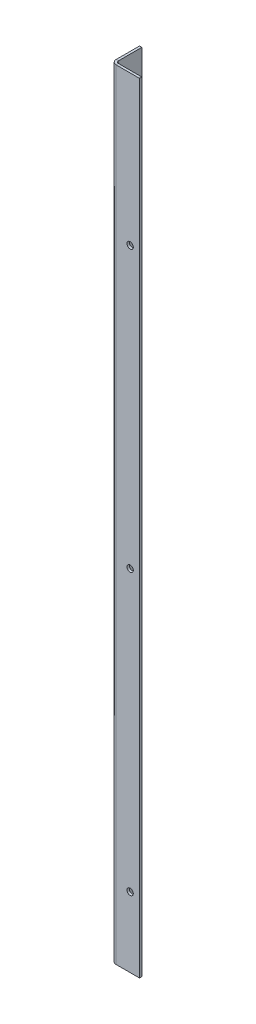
ISO-10303-21;
HEADER;
FILE_DESCRIPTION(('STEP AP214'),'2;1');
FILE_NAME('part.step','',(''),(''),'','','');
FILE_SCHEMA(('AUTOMOTIVE_DESIGN { 1 0 10303 214 1 1 1 1 }'));
ENDSEC;
DATA;
#1=APPLICATION_CONTEXT('core data for automotive mechanical design processes');
#2=APPLICATION_PROTOCOL_DEFINITION('international standard','automotive_design',2000,#1);
#3=PRODUCT_CONTEXT('',#1,'mechanical');
#4=PRODUCT('Part','Part','',(#3));
#5=PRODUCT_RELATED_PRODUCT_CATEGORY('part','',(#4));
#6=PRODUCT_DEFINITION_FORMATION('','',#4);
#7=PRODUCT_DEFINITION_CONTEXT('part definition',#1,'design');
#8=PRODUCT_DEFINITION('design','',#6,#7);
#9=PRODUCT_DEFINITION_SHAPE('','',#8);
#10=(LENGTH_UNIT() NAMED_UNIT(*) SI_UNIT(.MILLI.,.METRE.));
#11=(NAMED_UNIT(*) PLANE_ANGLE_UNIT() SI_UNIT($,.RADIAN.));
#12=(NAMED_UNIT(*) SI_UNIT($,.STERADIAN.) SOLID_ANGLE_UNIT());
#13=UNCERTAINTY_MEASURE_WITH_UNIT(LENGTH_MEASURE(1.E-05),#10,'distance_accuracy_value','');
#14=(GEOMETRIC_REPRESENTATION_CONTEXT(3) GLOBAL_UNCERTAINTY_ASSIGNED_CONTEXT((#13)) GLOBAL_UNIT_ASSIGNED_CONTEXT((#10,
#11,#12)) REPRESENTATION_CONTEXT('',''));
#15=CARTESIAN_POINT('',(0.,0.,0.));
#16=DIRECTION('',(0.,0.,1.));
#17=DIRECTION('',(1.,0.,0.));
#18=AXIS2_PLACEMENT_3D('',#15,#16,#17);
#19=CARTESIAN_POINT('',(5.,0.,30.));
#20=DIRECTION('',(0.,-1.00000000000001,0.));
#21=DIRECTION('',(0.,0.,-1.));
#22=AXIS2_PLACEMENT_3D('',#19,#20,#21);
#23=PLANE('',#22);
#24=CARTESIAN_POINT('',(5.,0.,25.));
#25=DIRECTION('',(0.,-1.00000000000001,0.));
#26=DIRECTION('',(0.,0.,-1.));
#27=AXIS2_PLACEMENT_3D('',#24,#25,#26);
#28=CIRCLE('',#27,5.);
#29=CARTESIAN_POINT('',(0.669872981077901,0.,27.5000000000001));
#30=VERTEX_POINT('',#29);
#31=CARTESIAN_POINT('',(5.,0.,30.));
#32=VERTEX_POINT('',#31);
#33=EDGE_CURVE('E129',#30,#32,#28,.F.);
#34=ORIENTED_EDGE('',*,*,#33,.F.);
#35=DIRECTION('',(-0.866025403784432,0.,0.50000000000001));
#36=VECTOR('',#35,1.);
#37=CARTESIAN_POINT('',(0.669872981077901,0.,27.5000000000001));
#38=LINE('',#37,#36);
#39=CARTESIAN_POINT('',(2.8349364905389,0.,26.25));
#40=VERTEX_POINT('',#39);
#41=EDGE_CURVE('E60',#30,#40,#38,.F.);
#42=ORIENTED_EDGE('',*,*,#41,.T.);
#43=CARTESIAN_POINT('',(5.,0.,25.));
#44=DIRECTION('',(0.,1.00000000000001,0.));
#45=DIRECTION('',(1.,0.,0.));
#46=AXIS2_PLACEMENT_3D('',#43,#44,#45);
#47=CIRCLE('',#46,2.5);
#48=CARTESIAN_POINT('',(5.,0.,27.5));
#49=VERTEX_POINT('',#48);
#50=EDGE_CURVE('E127',#40,#49,#47,.T.);
#51=ORIENTED_EDGE('',*,*,#50,.T.);
#52=DIRECTION('',(0.,0.,-1.));
#53=VECTOR('',#52,1.);
#54=CARTESIAN_POINT('',(5.,0.,30.));
#55=LINE('',#54,#53);
#56=EDGE_CURVE('E207',#32,#49,#55,.T.);
#57=ORIENTED_EDGE('',*,*,#56,.F.);
#58=EDGE_LOOP('',(#34,#42,#51,#57));
#59=FACE_BOUND('',#58,.T.);
#60=ADVANCED_FACE('F42',(#59),#23,.T.);
#61=CARTESIAN_POINT('',(5.00000000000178,835.00000000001,25.));
#62=DIRECTION('',(0.,-1.00000000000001,0.));
#63=DIRECTION('',(0.,0.,-1.));
#64=AXIS2_PLACEMENT_3D('',#61,#62,#63);
#65=CYLINDRICAL_SURFACE('',#64,2.5);
#66=ORIENTED_EDGE('',*,*,#50,.F.);
#67=CARTESIAN_POINT('',(5.,2.50000000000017,25.));
#68=DIRECTION('',(0.,0.447213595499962,0.894427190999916));
#69=DIRECTION('',(0.,-0.894427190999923,0.447213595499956));
#70=AXIS2_PLACEMENT_3D('',#67,#68,#69);
#71=ELLIPSE('',#70,5.59016994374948,2.5);
#72=CARTESIAN_POINT('',(2.50000000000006,2.49999999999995,25.));
#73=VERTEX_POINT('',#72);
#74=EDGE_CURVE('E113',#73,#40,#71,.T.);
#75=ORIENTED_EDGE('',*,*,#74,.F.);
#76=DIRECTION('',(0.,-1.00000000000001,0.));
#77=VECTOR('',#76,1.);
#78=CARTESIAN_POINT('',(2.50000000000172,835.00000000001,25.));
#79=LINE('',#78,#77);
#80=CARTESIAN_POINT('',(2.50000000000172,835.00000000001,25.));
#81=VERTEX_POINT('',#80);
#82=EDGE_CURVE('E196',#81,#73,#79,.T.);
#83=ORIENTED_EDGE('',*,*,#82,.F.);
#84=CARTESIAN_POINT('',(5.00000000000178,835.00000000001,25.));
#85=DIRECTION('',(0.,1.00000000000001,0.));
#86=DIRECTION('',(1.,0.,0.));
#87=AXIS2_PLACEMENT_3D('',#84,#85,#86);
#88=CIRCLE('',#87,2.5);
#89=CARTESIAN_POINT('',(5.00000000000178,835.00000000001,27.5));
#90=VERTEX_POINT('',#89);
#91=EDGE_CURVE('E162',#81,#90,#88,.T.);
#92=ORIENTED_EDGE('',*,*,#91,.T.);
#93=DIRECTION('',(0.,-1.00000000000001,0.));
#94=VECTOR('',#93,1.);
#95=CARTESIAN_POINT('',(5.00000000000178,835.00000000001,27.5));
#96=LINE('',#95,#94);
#97=EDGE_CURVE('E137',#90,#49,#96,.T.);
#98=ORIENTED_EDGE('',*,*,#97,.T.);
#99=EDGE_LOOP('',(#66,#75,#83,#92,#98));
#100=FACE_BOUND('',#99,.T.);
#101=ADVANCED_FACE('F134',(#100),#65,.F.);
#102=CARTESIAN_POINT('',(2.50000000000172,835.00000000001,0.));
#103=DIRECTION('',(1.,0.,0.));
#104=DIRECTION('',(0.,0.,-1.));
#105=AXIS2_PLACEMENT_3D('',#102,#103,#104);
#106=PLANE('',#105);
#107=CARTESIAN_POINT('',(2.50000000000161,155.000000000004,15.0000000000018));
#108=DIRECTION('',(1.,0.,0.));
#109=DIRECTION('',(0.,0.,-1.));
#110=AXIS2_PLACEMENT_3D('',#107,#108,#109);
#111=CIRCLE('',#110,4.55);
#112=CARTESIAN_POINT('',(2.5000000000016,155.000000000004,10.4500000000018));
#113=VERTEX_POINT('',#112);
#114=EDGE_CURVE('E381',#113,#113,#111,.T.);
#115=ORIENTED_EDGE('',*,*,#114,.F.);
#116=EDGE_LOOP('',(#115));
#117=FACE_BOUND('',#116,.T.);
#118=CARTESIAN_POINT('',(2.50000000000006,125.000000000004,15.));
#119=DIRECTION('',(1.,0.,0.));
#120=DIRECTION('',(0.,0.,-1.));
#121=AXIS2_PLACEMENT_3D('',#118,#119,#120);
#122=CIRCLE('',#121,4.55);
#123=CARTESIAN_POINT('',(2.50000000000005,125.000000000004,10.45));
#124=VERTEX_POINT('',#123);
#125=EDGE_CURVE('E395',#124,#124,#122,.T.);
#126=ORIENTED_EDGE('',*,*,#125,.F.);
#127=EDGE_LOOP('',(#126));
#128=FACE_BOUND('',#127,.T.);
#129=CARTESIAN_POINT('',(2.50000000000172,725.000000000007,15.0000000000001));
#130=DIRECTION('',(1.,0.,0.));
#131=DIRECTION('',(0.,0.,-1.));
#132=AXIS2_PLACEMENT_3D('',#129,#130,#131);
#133=CIRCLE('',#132,4.54999999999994);
#134=CARTESIAN_POINT('',(2.50000000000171,725.000000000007,10.4500000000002));
#135=VERTEX_POINT('',#134);
#136=EDGE_CURVE('E403',#135,#135,#133,.T.);
#137=ORIENTED_EDGE('',*,*,#136,.F.);
#138=EDGE_LOOP('',(#137));
#139=FACE_BOUND('',#138,.T.);
#140=CARTESIAN_POINT('',(2.50000000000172,755.000000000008,15.0000000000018));
#141=DIRECTION('',(1.,0.,0.));
#142=DIRECTION('',(0.,0.,-1.));
#143=AXIS2_PLACEMENT_3D('',#140,#141,#142);
#144=CIRCLE('',#143,4.54999999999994);
#145=CARTESIAN_POINT('',(2.50000000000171,755.000000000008,10.4500000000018));
#146=VERTEX_POINT('',#145);
#147=EDGE_CURVE('E409',#146,#146,#144,.T.);
#148=ORIENTED_EDGE('',*,*,#147,.F.);
#149=EDGE_LOOP('',(#148));
#150=FACE_BOUND('',#149,.T.);
#151=ORIENTED_EDGE('',*,*,#82,.T.);
#152=DIRECTION('',(0.,-0.707106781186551,0.707106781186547));
#153=VECTOR('',#152,1.);
#154=CARTESIAN_POINT('',(2.50000000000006,0.,27.5));
#155=LINE('',#154,#153);
#156=CARTESIAN_POINT('',(2.50000000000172,27.5000000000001,1.77635683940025E-12));
#157=VERTEX_POINT('',#156);
#158=EDGE_CURVE('E241',#157,#73,#155,.T.);
#159=ORIENTED_EDGE('',*,*,#158,.F.);
#160=DIRECTION('',(0.,-1.00000000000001,0.));
#161=VECTOR('',#160,1.);
#162=CARTESIAN_POINT('',(2.50000000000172,835.00000000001,0.));
#163=LINE('',#162,#161);
#164=CARTESIAN_POINT('',(2.50000000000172,835.00000000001,0.));
#165=VERTEX_POINT('',#164);
#166=EDGE_CURVE('E192',#165,#157,#163,.T.);
#167=ORIENTED_EDGE('',*,*,#166,.F.);
#168=DIRECTION('',(0.,0.,1.));
#169=VECTOR('',#168,1.);
#170=CARTESIAN_POINT('',(2.50000000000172,835.00000000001,0.));
#171=LINE('',#170,#169);
#172=EDGE_CURVE('E165',#165,#81,#171,.T.);
#173=ORIENTED_EDGE('',*,*,#172,.T.);
#174=EDGE_LOOP('',(#151,#159,#167,#173));
#175=FACE_BOUND('',#174,.T.);
#176=ADVANCED_FACE('F281',(#117,#128,#139,#150,#175),#106,.T.);
#177=CARTESIAN_POINT('',(1.77635683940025E-12,835.00000000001,0.));
#178=DIRECTION('',(0.,0.,-1.));
#179=DIRECTION('',(-1.,0.,0.));
#180=AXIS2_PLACEMENT_3D('',#177,#178,#179);
#181=PLANE('',#180);
#182=ORIENTED_EDGE('',*,*,#166,.T.);
#183=DIRECTION('',(-1.,0.,0.));
#184=VECTOR('',#183,1.);
#185=CARTESIAN_POINT('',(1.66533453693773E-12,27.5000000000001,1.77635683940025E-12));
#186=LINE('',#185,#184);
#187=CARTESIAN_POINT('',(1.66533453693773E-12,27.5000000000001,1.77635683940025E-12));
#188=VERTEX_POINT('',#187);
#189=EDGE_CURVE('E244',#188,#157,#186,.F.);
#190=ORIENTED_EDGE('',*,*,#189,.F.);
#191=DIRECTION('',(0.,-1.00000000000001,0.));
#192=VECTOR('',#191,1.);
#193=CARTESIAN_POINT('',(1.77635683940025E-12,835.00000000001,0.));
#194=LINE('',#193,#192);
#195=CARTESIAN_POINT('',(1.77635683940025E-12,835.00000000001,0.));
#196=VERTEX_POINT('',#195);
#197=EDGE_CURVE('E188',#196,#188,#194,.T.);
#198=ORIENTED_EDGE('',*,*,#197,.F.);
#199=DIRECTION('',(1.,0.,0.));
#200=VECTOR('',#199,1.);
#201=CARTESIAN_POINT('',(1.77635683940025E-12,835.00000000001,0.));
#202=LINE('',#201,#200);
#203=EDGE_CURVE('E169',#196,#165,#202,.T.);
#204=ORIENTED_EDGE('',*,*,#203,.T.);
#205=EDGE_LOOP('',(#182,#190,#198,#204));
#206=FACE_BOUND('',#205,.T.);
#207=ADVANCED_FACE('F279',(#206),#181,.T.);
#208=CARTESIAN_POINT('',(1.77635683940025E-12,835.00000000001,0.));
#209=DIRECTION('',(1.,0.,0.));
#210=DIRECTION('',(0.,0.,-1.));
#211=AXIS2_PLACEMENT_3D('',#208,#209,#210);
#212=PLANE('',#211);
#213=CARTESIAN_POINT('',(1.66533453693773E-12,155.000000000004,15.0000000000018));
#214=DIRECTION('',(-1.,0.,0.));
#215=DIRECTION('',(0.,0.,1.));
#216=AXIS2_PLACEMENT_3D('',#213,#214,#215);
#217=CIRCLE('',#216,4.55);
#218=CARTESIAN_POINT('',(1.67346900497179E-12,155.000000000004,19.5500000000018));
#219=VERTEX_POINT('',#218);
#220=EDGE_CURVE('E384',#219,#219,#217,.T.);
#221=ORIENTED_EDGE('',*,*,#220,.F.);
#222=EDGE_LOOP('',(#221));
#223=FACE_BOUND('',#222,.T.);
#224=CARTESIAN_POINT('',(1.11022302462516E-13,125.000000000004,15.));
#225=DIRECTION('',(-1.,0.,0.));
#226=DIRECTION('',(0.,0.,1.));
#227=AXIS2_PLACEMENT_3D('',#224,#225,#226);
#228=CIRCLE('',#227,4.55);
#229=CARTESIAN_POINT('',(1.19156770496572E-13,125.000000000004,19.55));
#230=VERTEX_POINT('',#229);
#231=EDGE_CURVE('E389',#230,#230,#228,.T.);
#232=ORIENTED_EDGE('',*,*,#231,.F.);
#233=EDGE_LOOP('',(#232));
#234=FACE_BOUND('',#233,.T.);
#235=CARTESIAN_POINT('',(1.77635683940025E-12,725.000000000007,15.0000000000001));
#236=DIRECTION('',(-1.,0.,0.));
#237=DIRECTION('',(0.,0.,1.));
#238=AXIS2_PLACEMENT_3D('',#235,#236,#237);
#239=CIRCLE('',#238,4.54999999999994);
#240=CARTESIAN_POINT('',(1.78449130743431E-12,725.000000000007,19.5500000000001));
#241=VERTEX_POINT('',#240);
#242=EDGE_CURVE('E399',#241,#241,#239,.T.);
#243=ORIENTED_EDGE('',*,*,#242,.F.);
#244=EDGE_LOOP('',(#243));
#245=FACE_BOUND('',#244,.T.);
#246=CARTESIAN_POINT('',(1.77635683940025E-12,755.000000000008,15.0000000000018));
#247=DIRECTION('',(-1.,0.,0.));
#248=DIRECTION('',(0.,0.,1.));
#249=AXIS2_PLACEMENT_3D('',#246,#247,#248);
#250=CIRCLE('',#249,4.54999999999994);
#251=CARTESIAN_POINT('',(1.78449130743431E-12,755.000000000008,19.5500000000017));
#252=VERTEX_POINT('',#251);
#253=EDGE_CURVE('E407',#252,#252,#250,.T.);
#254=ORIENTED_EDGE('',*,*,#253,.F.);
#255=EDGE_LOOP('',(#254));
#256=FACE_BOUND('',#255,.T.);
#257=DIRECTION('',(0.,-0.707106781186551,0.707106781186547));
#258=VECTOR('',#257,1.);
#259=CARTESIAN_POINT('',(0.,0.,27.5));
#260=LINE('',#259,#258);
#261=CARTESIAN_POINT('',(0.,2.49999999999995,25.));
#262=VERTEX_POINT('',#261);
#263=EDGE_CURVE('E131',#188,#262,#260,.T.);
#264=ORIENTED_EDGE('',*,*,#263,.T.);
#265=DIRECTION('',(0.,-1.00000000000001,0.));
#266=VECTOR('',#265,1.);
#267=CARTESIAN_POINT('',(1.77635683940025E-12,835.00000000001,25.));
#268=LINE('',#267,#266);
#269=CARTESIAN_POINT('',(1.77635683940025E-12,835.00000000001,25.));
#270=VERTEX_POINT('',#269);
#271=EDGE_CURVE('E184',#270,#262,#268,.T.);
#272=ORIENTED_EDGE('',*,*,#271,.F.);
#273=DIRECTION('',(0.,0.,1.));
#274=VECTOR('',#273,1.);
#275=CARTESIAN_POINT('',(1.77635683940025E-12,835.00000000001,0.));
#276=LINE('',#275,#274);
#277=EDGE_CURVE('E173',#196,#270,#276,.T.);
#278=ORIENTED_EDGE('',*,*,#277,.F.);
#279=ORIENTED_EDGE('',*,*,#197,.T.);
#280=EDGE_LOOP('',(#264,#272,#278,#279));
#281=FACE_BOUND('',#280,.T.);
#282=ADVANCED_FACE('F275',(#223,#234,#245,#256,#281),#212,.F.);
#283=CARTESIAN_POINT('',(5.00000000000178,835.00000000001,25.));
#284=DIRECTION('',(0.,-1.00000000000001,0.));
#285=DIRECTION('',(0.,0.,-1.));
#286=AXIS2_PLACEMENT_3D('',#283,#284,#285);
#287=CYLINDRICAL_SURFACE('',#286,5.);
#288=CARTESIAN_POINT('',(5.,2.50000000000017,25.));
#289=DIRECTION('',(0.,0.707106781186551,0.707106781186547));
#290=DIRECTION('',(0.,-0.707106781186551,0.707106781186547));
#291=AXIS2_PLACEMENT_3D('',#288,#289,#290);
#292=ELLIPSE('',#291,7.07106781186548,5.);
#293=EDGE_CURVE('E122',#262,#30,#292,.T.);
#294=ORIENTED_EDGE('',*,*,#293,.T.);
#295=ORIENTED_EDGE('',*,*,#33,.T.);
#296=DIRECTION('',(0.,-1.00000000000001,0.));
#297=VECTOR('',#296,1.);
#298=CARTESIAN_POINT('',(5.00000000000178,835.00000000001,30.));
#299=LINE('',#298,#297);
#300=CARTESIAN_POINT('',(5.00000000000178,835.00000000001,30.));
#301=VERTEX_POINT('',#300);
#302=EDGE_CURVE('E180',#301,#32,#299,.T.);
#303=ORIENTED_EDGE('',*,*,#302,.F.);
#304=CARTESIAN_POINT('',(5.00000000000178,835.00000000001,25.));
#305=DIRECTION('',(0.,-1.00000000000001,0.));
#306=DIRECTION('',(0.,0.,-1.));
#307=AXIS2_PLACEMENT_3D('',#304,#305,#306);
#308=CIRCLE('',#307,5.);
#309=EDGE_CURVE('E177',#270,#301,#308,.F.);
#310=ORIENTED_EDGE('',*,*,#309,.F.);
#311=ORIENTED_EDGE('',*,*,#271,.T.);
#312=EDGE_LOOP('',(#294,#295,#303,#310,#311));
#313=FACE_BOUND('',#312,.T.);
#314=ADVANCED_FACE('F268',(#313),#287,.T.);
#315=CARTESIAN_POINT('',(1.77635683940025E-12,835.00000000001,25.));
#316=DIRECTION('',(0.,1.00000000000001,0.));
#317=DIRECTION('',(0.,0.,1.));
#318=AXIS2_PLACEMENT_3D('',#315,#316,#317);
#319=PLANE('',#318);
#320=DIRECTION('',(1.,0.,0.));
#321=VECTOR('',#320,1.);
#322=CARTESIAN_POINT('',(1.77635683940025E-12,835.00000000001,25.));
#323=LINE('',#322,#321);
#324=EDGE_CURVE('E11',#270,#81,#323,.T.);
#325=ORIENTED_EDGE('',*,*,#324,.F.);
#326=ORIENTED_EDGE('',*,*,#309,.T.);
#327=DIRECTION('',(0.,0.,1.));
#328=VECTOR('',#327,1.);
#329=CARTESIAN_POINT('',(5.00000000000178,835.00000000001,27.5));
#330=LINE('',#329,#328);
#331=EDGE_CURVE('E52',#90,#301,#330,.T.);
#332=ORIENTED_EDGE('',*,*,#331,.F.);
#333=ORIENTED_EDGE('',*,*,#91,.F.);
#334=EDGE_LOOP('',(#325,#326,#332,#333));
#335=FACE_BOUND('',#334,.T.);
#336=ADVANCED_FACE('F44',(#335),#319,.T.);
#337=CARTESIAN_POINT('',(5.00000000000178,835.00000000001,27.5));
#338=DIRECTION('',(0.,1.00000000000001,0.));
#339=DIRECTION('',(0.,0.,1.));
#340=AXIS2_PLACEMENT_3D('',#337,#338,#339);
#341=PLANE('',#340);
#342=ORIENTED_EDGE('',*,*,#277,.T.);
#343=ORIENTED_EDGE('',*,*,#324,.T.);
#344=ORIENTED_EDGE('',*,*,#172,.F.);
#345=ORIENTED_EDGE('',*,*,#203,.F.);
#346=EDGE_LOOP('',(#342,#343,#344,#345));
#347=FACE_BOUND('',#346,.T.);
#348=ADVANCED_FACE('F306',(#347),#341,.T.);
#349=CARTESIAN_POINT('',(2.50000000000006,0.,25.));
#350=DIRECTION('',(0.,-1.00000000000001,0.));
#351=DIRECTION('',(0.,0.,-1.));
#352=AXIS2_PLACEMENT_3D('',#349,#350,#351);
#353=PLANE('',#352);
#354=DIRECTION('',(1.,0.,0.));
#355=VECTOR('',#354,1.);
#356=CARTESIAN_POINT('',(0.,0.,30.));
#357=LINE('',#356,#355);
#358=CARTESIAN_POINT('',(30.,3.33066907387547E-12,30.));
#359=VERTEX_POINT('',#358);
#360=EDGE_CURVE('E247',#32,#359,#357,.T.);
#361=ORIENTED_EDGE('',*,*,#360,.F.);
#362=ORIENTED_EDGE('',*,*,#56,.T.);
#363=DIRECTION('',(1.,0.,0.));
#364=VECTOR('',#363,1.);
#365=CARTESIAN_POINT('',(0.,0.,27.5));
#366=LINE('',#365,#364);
#367=CARTESIAN_POINT('',(30.,3.33066907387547E-12,27.5));
#368=VERTEX_POINT('',#367);
#369=EDGE_CURVE('E140',#49,#368,#366,.T.);
#370=ORIENTED_EDGE('',*,*,#369,.T.);
#371=DIRECTION('',(0.,0.,1.));
#372=VECTOR('',#371,1.);
#373=CARTESIAN_POINT('',(30.,3.33066907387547E-12,27.5));
#374=LINE('',#373,#372);
#375=EDGE_CURVE('E148',#368,#359,#374,.T.);
#376=ORIENTED_EDGE('',*,*,#375,.T.);
#377=EDGE_LOOP('',(#361,#362,#370,#376));
#378=FACE_BOUND('',#377,.T.);
#379=ADVANCED_FACE('F257',(#378),#353,.T.);
#380=CARTESIAN_POINT('',(1.77635683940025E-12,835.00000000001,30.));
#381=DIRECTION('',(0.,0.,-0.999999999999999));
#382=DIRECTION('',(-1.,0.,0.));
#383=AXIS2_PLACEMENT_3D('',#380,#381,#382);
#384=PLANE('',#383);
#385=CARTESIAN_POINT('',(20.0000000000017,75.0000000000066,30.));
#386=DIRECTION('',(0.,0.,1.));
#387=DIRECTION('',(1.,0.,0.));
#388=AXIS2_PLACEMENT_3D('',#385,#386,#387);
#389=CIRCLE('',#388,3.40000000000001);
#390=CARTESIAN_POINT('',(23.4000000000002,75.0000000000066,30.));
#391=VERTEX_POINT('',#390);
#392=EDGE_CURVE('E232',#391,#391,#389,.T.);
#393=ORIENTED_EDGE('',*,*,#392,.F.);
#394=EDGE_LOOP('',(#393));
#395=FACE_BOUND('',#394,.T.);
#396=CARTESIAN_POINT('',(20.0000000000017,375.000000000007,30.0000000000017));
#397=DIRECTION('',(0.,0.,1.));
#398=DIRECTION('',(1.,0.,0.));
#399=AXIS2_PLACEMENT_3D('',#396,#397,#398);
#400=CIRCLE('',#399,3.39999999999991);
#401=CARTESIAN_POINT('',(23.4000000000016,375.00000000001,30.0000000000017));
#402=VERTEX_POINT('',#401);
#403=EDGE_CURVE('E219',#402,#402,#400,.T.);
#404=ORIENTED_EDGE('',*,*,#403,.F.);
#405=EDGE_LOOP('',(#404));
#406=FACE_BOUND('',#405,.T.);
#407=CARTESIAN_POINT('',(20.0000000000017,675.000000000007,30.));
#408=DIRECTION('',(0.,0.,1.));
#409=DIRECTION('',(1.,0.,0.));
#410=AXIS2_PLACEMENT_3D('',#407,#408,#409);
#411=CIRCLE('',#410,3.39999999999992);
#412=CARTESIAN_POINT('',(23.4000000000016,675.000000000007,30.));
#413=VERTEX_POINT('',#412);
#414=EDGE_CURVE('E215',#413,#413,#411,.T.);
#415=ORIENTED_EDGE('',*,*,#414,.F.);
#416=EDGE_LOOP('',(#415));
#417=FACE_BOUND('',#416,.T.);
#418=ORIENTED_EDGE('',*,*,#360,.T.);
#419=DIRECTION('',(0.,-1.00000000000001,0.));
#420=VECTOR('',#419,1.);
#421=CARTESIAN_POINT('',(30.0000000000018,835.000000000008,30.));
#422=LINE('',#421,#420);
#423=CARTESIAN_POINT('',(30.0000000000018,835.000000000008,30.));
#424=VERTEX_POINT('',#423);
#425=EDGE_CURVE('E204',#424,#359,#422,.T.);
#426=ORIENTED_EDGE('',*,*,#425,.F.);
#427=DIRECTION('',(1.,0.,0.));
#428=VECTOR('',#427,1.);
#429=CARTESIAN_POINT('',(1.77635683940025E-12,835.00000000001,30.));
#430=LINE('',#429,#428);
#431=EDGE_CURVE('E144',#301,#424,#430,.T.);
#432=ORIENTED_EDGE('',*,*,#431,.F.);
#433=ORIENTED_EDGE('',*,*,#302,.T.);
#434=EDGE_LOOP('',(#418,#426,#432,#433));
#435=FACE_BOUND('',#434,.T.);
#436=ADVANCED_FACE('F264',(#395,#406,#417,#435),#384,.F.);
#437=CARTESIAN_POINT('',(30.0000000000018,835.000000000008,27.5));
#438=DIRECTION('',(1.,0.,0.));
#439=DIRECTION('',(0.,0.,-1.));
#440=AXIS2_PLACEMENT_3D('',#437,#438,#439);
#441=PLANE('',#440);
#442=ORIENTED_EDGE('',*,*,#375,.F.);
#443=DIRECTION('',(0.,-1.00000000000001,0.));
#444=VECTOR('',#443,1.);
#445=CARTESIAN_POINT('',(30.0000000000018,835.000000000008,27.5));
#446=LINE('',#445,#444);
#447=CARTESIAN_POINT('',(30.0000000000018,835.000000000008,27.5));
#448=VERTEX_POINT('',#447);
#449=EDGE_CURVE('E201',#448,#368,#446,.T.);
#450=ORIENTED_EDGE('',*,*,#449,.F.);
#451=DIRECTION('',(0.,0.,1.));
#452=VECTOR('',#451,1.);
#453=CARTESIAN_POINT('',(30.0000000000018,835.000000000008,27.5));
#454=LINE('',#453,#452);
#455=EDGE_CURVE('E154',#448,#424,#454,.T.);
#456=ORIENTED_EDGE('',*,*,#455,.T.);
#457=ORIENTED_EDGE('',*,*,#425,.T.);
#458=EDGE_LOOP('',(#442,#450,#456,#457));
#459=FACE_BOUND('',#458,.T.);
#460=ADVANCED_FACE('F259',(#459),#441,.T.);
#461=CARTESIAN_POINT('',(1.77635683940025E-12,835.00000000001,27.5));
#462=DIRECTION('',(0.,0.,-1.));
#463=DIRECTION('',(-1.,0.,0.));
#464=AXIS2_PLACEMENT_3D('',#461,#462,#463);
#465=PLANE('',#464);
#466=CARTESIAN_POINT('',(20.0000000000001,75.0000000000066,27.5));
#467=DIRECTION('',(0.,0.,-1.));
#468=DIRECTION('',(-1.,0.,0.));
#469=AXIS2_PLACEMENT_3D('',#466,#467,#468);
#470=CIRCLE('',#469,3.40000000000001);
#471=CARTESIAN_POINT('',(23.4000000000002,75.0000000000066,27.5));
#472=VERTEX_POINT('',#471);
#473=EDGE_CURVE('E46',#472,#472,#470,.T.);
#474=ORIENTED_EDGE('',*,*,#473,.F.);
#475=EDGE_LOOP('',(#474));
#476=FACE_BOUND('',#475,.T.);
#477=CARTESIAN_POINT('',(20.0000000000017,375.000000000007,27.5000000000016));
#478=DIRECTION('',(0.,0.,-1.));
#479=DIRECTION('',(-1.,0.,0.));
#480=AXIS2_PLACEMENT_3D('',#477,#478,#479);
#481=CIRCLE('',#480,3.39999999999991);
#482=CARTESIAN_POINT('',(23.4000000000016,375.00000000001,27.5000000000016));
#483=VERTEX_POINT('',#482);
#484=EDGE_CURVE('E216',#483,#483,#481,.T.);
#485=ORIENTED_EDGE('',*,*,#484,.F.);
#486=EDGE_LOOP('',(#485));
#487=FACE_BOUND('',#486,.T.);
#488=CARTESIAN_POINT('',(20.0000000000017,675.000000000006,27.5));
#489=DIRECTION('',(0.,0.,-1.));
#490=DIRECTION('',(-1.,0.,0.));
#491=AXIS2_PLACEMENT_3D('',#488,#489,#490);
#492=CIRCLE('',#491,3.39999999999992);
#493=CARTESIAN_POINT('',(23.4000000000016,675.000000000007,27.5));
#494=VERTEX_POINT('',#493);
#495=EDGE_CURVE('E212',#494,#494,#492,.T.);
#496=ORIENTED_EDGE('',*,*,#495,.F.);
#497=EDGE_LOOP('',(#496));
#498=FACE_BOUND('',#497,.T.);
#499=ORIENTED_EDGE('',*,*,#369,.F.);
#500=ORIENTED_EDGE('',*,*,#97,.F.);
#501=DIRECTION('',(1.,0.,0.));
#502=VECTOR('',#501,1.);
#503=CARTESIAN_POINT('',(1.77635683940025E-12,835.00000000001,27.5));
#504=LINE('',#503,#502);
#505=EDGE_CURVE('E158',#90,#448,#504,.T.);
#506=ORIENTED_EDGE('',*,*,#505,.T.);
#507=ORIENTED_EDGE('',*,*,#449,.T.);
#508=EDGE_LOOP('',(#499,#500,#506,#507));
#509=FACE_BOUND('',#508,.T.);
#510=ADVANCED_FACE('F286',(#476,#487,#498,#509),#465,.T.);
#511=CARTESIAN_POINT('',(5.00000000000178,835.00000000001,25.));
#512=DIRECTION('',(0.,1.00000000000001,0.));
#513=DIRECTION('',(0.,0.,1.));
#514=AXIS2_PLACEMENT_3D('',#511,#512,#513);
#515=PLANE('',#514);
#516=ORIENTED_EDGE('',*,*,#431,.T.);
#517=ORIENTED_EDGE('',*,*,#455,.F.);
#518=ORIENTED_EDGE('',*,*,#505,.F.);
#519=ORIENTED_EDGE('',*,*,#331,.T.);
#520=EDGE_LOOP('',(#516,#517,#518,#519));
#521=FACE_BOUND('',#520,.T.);
#522=ADVANCED_FACE('F287',(#521),#515,.T.);
#523=CARTESIAN_POINT('',(0.,0.,27.5));
#524=DIRECTION('',(0.,0.707106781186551,0.707106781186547));
#525=DIRECTION('',(0.,-0.707106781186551,0.707106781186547));
#526=AXIS2_PLACEMENT_3D('',#523,#524,#525);
#527=PLANE('',#526);
#528=DIRECTION('',(-1.,0.,0.));
#529=VECTOR('',#528,1.);
#530=CARTESIAN_POINT('',(0.,2.49999999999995,25.));
#531=LINE('',#530,#529);
#532=EDGE_CURVE('E116',#262,#73,#531,.F.);
#533=ORIENTED_EDGE('',*,*,#532,.F.);
#534=ORIENTED_EDGE('',*,*,#263,.F.);
#535=ORIENTED_EDGE('',*,*,#189,.T.);
#536=ORIENTED_EDGE('',*,*,#158,.T.);
#537=EDGE_LOOP('',(#533,#534,#535,#536));
#538=FACE_BOUND('',#537,.T.);
#539=ADVANCED_FACE('F271',(#538),#527,.F.);
#540=CARTESIAN_POINT('',(5.,-2.49999999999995,27.5));
#541=CARTESIAN_POINT('',(5.,-2.49999999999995,28.3333333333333));
#542=CARTESIAN_POINT('',(5.,-2.49999999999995,29.1666666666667));
#543=CARTESIAN_POINT('',(5.,-2.49999999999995,30.));
#544=CARTESIAN_POINT('',(10.0000000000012,-2.49999999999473,27.5));
#545=CARTESIAN_POINT('',(11.6666666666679,-2.49999999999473,28.3333333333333));
#546=CARTESIAN_POINT('',(13.3333333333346,-2.49999999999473,29.1666666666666));
#547=CARTESIAN_POINT('',(15.0000000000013,-2.49999999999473,29.9999999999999));
#548=CARTESIAN_POINT('',(10.0000000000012,7.50000000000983,22.5000000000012));
#549=CARTESIAN_POINT('',(11.6666666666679,7.50000000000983,21.6666666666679));
#550=CARTESIAN_POINT('',(13.3333333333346,7.50000000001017,20.8333333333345));
#551=CARTESIAN_POINT('',(15.0000000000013,7.50000000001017,20.0000000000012));
#552=CARTESIAN_POINT('',(5.,7.50000000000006,22.5000000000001));
#553=CARTESIAN_POINT('',(5.,7.50000000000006,21.6666666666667));
#554=CARTESIAN_POINT('',(5.,7.50000000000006,20.8333333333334));
#555=CARTESIAN_POINT('',(5.,7.50000000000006,20.));
#556=CARTESIAN_POINT('',(1.2490009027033E-12,7.50000000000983,22.5000000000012));
#557=CARTESIAN_POINT('',(-1.66666666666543,7.50000000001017,21.6666666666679));
#558=CARTESIAN_POINT('',(-3.33333333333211,7.50000000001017,20.8333333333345));
#559=CARTESIAN_POINT('',(-4.9999999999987,7.50000000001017,20.0000000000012));
#560=CARTESIAN_POINT('',(1.2490009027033E-12,-2.49999999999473,27.5));
#561=CARTESIAN_POINT('',(-1.66666666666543,-2.49999999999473,28.3333333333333));
#562=CARTESIAN_POINT('',(-3.33333333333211,-2.49999999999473,29.1666666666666));
#563=CARTESIAN_POINT('',(-4.9999999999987,-2.49999999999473,29.9999999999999));
#564=CARTESIAN_POINT('',(5.,-2.49999999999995,27.5));
#565=CARTESIAN_POINT('',(5.,-2.49999999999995,28.3333333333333));
#566=CARTESIAN_POINT('',(5.,-2.49999999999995,29.1666666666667));
#567=CARTESIAN_POINT('',(5.,-2.49999999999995,30.));
#568=(BOUNDED_SURFACE() B_SPLINE_SURFACE(3,3,((#540,#541,#542,#543),(#544,#545,#546,#547),(#548,
#549,#550,#551),(#552,#553,#554,#555),(#556,#557,#558,#559),(#560,#561,#562,#563),(#564,#565,
#566,#567)),.UNSPECIFIED.,.T.,.F.,.F.) B_SPLINE_SURFACE_WITH_KNOTS((4,3,4),(4,4),(0.,0.5,1.),
(0.,1.),.UNSPECIFIED.) GEOMETRIC_REPRESENTATION_ITEM() RATIONAL_B_SPLINE_SURFACE(((1.,1.,1.,1.),
(0.333333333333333,0.333333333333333,0.333333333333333,0.333333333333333),(0.333333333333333,
0.333333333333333,0.333333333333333,0.333333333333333),(1.,1.,1.,1.),(0.333333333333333,
0.333333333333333,0.333333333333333,0.333333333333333),(0.333333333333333,0.333333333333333,
0.333333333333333,0.333333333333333),(1.,1.,1.,1.))) REPRESENTATION_ITEM('') SURFACE());
#569=ORIENTED_EDGE('',*,*,#41,.F.);
#570=ORIENTED_EDGE('',*,*,#293,.F.);
#571=ORIENTED_EDGE('',*,*,#532,.T.);
#572=ORIENTED_EDGE('',*,*,#74,.T.);
#573=EDGE_LOOP('',(#569,#570,#571,#572));
#574=FACE_BOUND('',#573,.T.);
#575=ADVANCED_FACE('F114',(#574),#568,.T.);
#576=CARTESIAN_POINT('',(20.0000000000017,675.000000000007,20.));
#577=DIRECTION('',(0.,0.,1.));
#578=DIRECTION('',(1.,0.,0.));
#579=AXIS2_PLACEMENT_3D('',#576,#577,#578);
#580=CYLINDRICAL_SURFACE('',#579,3.39999999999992);
#581=CARTESIAN_POINT('',(23.4000000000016,675.000000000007,27.5));
#582=CARTESIAN_POINT('',(23.4000000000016,675.000000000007,27.5260416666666));
#583=CARTESIAN_POINT('',(23.4000000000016,675.000000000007,27.5520833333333));
#584=CARTESIAN_POINT('',(23.4000000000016,675.000000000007,27.6041666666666));
#585=CARTESIAN_POINT('',(23.4000000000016,675.000000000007,27.6302083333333));
#586=CARTESIAN_POINT('',(23.4000000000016,675.000000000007,27.6822916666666));
#587=CARTESIAN_POINT('',(23.4000000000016,675.000000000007,27.7083333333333));
#588=CARTESIAN_POINT('',(23.4000000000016,675.000000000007,27.7604166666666));
#589=CARTESIAN_POINT('',(23.4000000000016,675.000000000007,27.7864583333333));
#590=CARTESIAN_POINT('',(23.4000000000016,675.000000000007,27.8385416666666));
#591=CARTESIAN_POINT('',(23.4000000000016,675.000000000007,27.8645833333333));
#592=CARTESIAN_POINT('',(23.4000000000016,675.000000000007,27.9166666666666));
#593=CARTESIAN_POINT('',(23.4000000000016,675.000000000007,27.9427083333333));
#594=CARTESIAN_POINT('',(23.4000000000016,675.000000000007,27.9947916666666));
#595=CARTESIAN_POINT('',(23.4000000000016,675.000000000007,28.0208333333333));
#596=CARTESIAN_POINT('',(23.4000000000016,675.000000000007,28.0729166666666));
#597=CARTESIAN_POINT('',(23.4000000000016,675.000000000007,28.0989583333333));
#598=CARTESIAN_POINT('',(23.4000000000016,675.000000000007,28.1510416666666));
#599=CARTESIAN_POINT('',(23.4000000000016,675.000000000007,28.1770833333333));
#600=CARTESIAN_POINT('',(23.4000000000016,675.000000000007,28.2291666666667));
#601=CARTESIAN_POINT('',(23.4000000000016,675.000000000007,28.2552083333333));
#602=CARTESIAN_POINT('',(23.4000000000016,675.000000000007,28.3072916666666));
#603=CARTESIAN_POINT('',(23.4000000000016,675.000000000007,28.3333333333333));
#604=CARTESIAN_POINT('',(23.4000000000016,675.000000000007,28.3854166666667));
#605=CARTESIAN_POINT('',(23.4000000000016,675.000000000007,28.4114583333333));
#606=CARTESIAN_POINT('',(23.4000000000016,675.000000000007,28.4635416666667));
#607=CARTESIAN_POINT('',(23.4000000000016,675.000000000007,28.4895833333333));
#608=CARTESIAN_POINT('',(23.4000000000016,675.000000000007,28.5416666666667));
#609=CARTESIAN_POINT('',(23.4000000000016,675.000000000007,28.5677083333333));
#610=CARTESIAN_POINT('',(23.4000000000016,675.000000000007,28.6197916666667));
#611=CARTESIAN_POINT('',(23.4000000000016,675.000000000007,28.6458333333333));
#612=CARTESIAN_POINT('',(23.4000000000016,675.000000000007,28.6979166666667));
#613=CARTESIAN_POINT('',(23.4000000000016,675.000000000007,28.7239583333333));
#614=CARTESIAN_POINT('',(23.4000000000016,675.000000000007,28.7760416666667));
#615=CARTESIAN_POINT('',(23.4000000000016,675.000000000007,28.8020833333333));
#616=CARTESIAN_POINT('',(23.4000000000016,675.000000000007,28.8541666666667));
#617=CARTESIAN_POINT('',(23.4000000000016,675.000000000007,28.8802083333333));
#618=CARTESIAN_POINT('',(23.4000000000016,675.000000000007,28.9322916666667));
#619=CARTESIAN_POINT('',(23.4000000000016,675.000000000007,28.9583333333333));
#620=CARTESIAN_POINT('',(23.4000000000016,675.000000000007,29.0104166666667));
#621=CARTESIAN_POINT('',(23.4000000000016,675.000000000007,29.0364583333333));
#622=CARTESIAN_POINT('',(23.4000000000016,675.000000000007,29.0885416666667));
#623=CARTESIAN_POINT('',(23.4000000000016,675.000000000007,29.1145833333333));
#624=CARTESIAN_POINT('',(23.4000000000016,675.000000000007,29.1666666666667));
#625=CARTESIAN_POINT('',(23.4000000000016,675.000000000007,29.1927083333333));
#626=CARTESIAN_POINT('',(23.4000000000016,675.000000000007,29.2447916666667));
#627=CARTESIAN_POINT('',(23.4000000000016,675.000000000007,29.2708333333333));
#628=CARTESIAN_POINT('',(23.4000000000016,675.000000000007,29.3229166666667));
#629=CARTESIAN_POINT('',(23.4000000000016,675.000000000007,29.3489583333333));
#630=CARTESIAN_POINT('',(23.4000000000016,675.000000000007,29.4010416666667));
#631=CARTESIAN_POINT('',(23.4000000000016,675.000000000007,29.4270833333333));
#632=CARTESIAN_POINT('',(23.4000000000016,675.000000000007,29.4791666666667));
#633=CARTESIAN_POINT('',(23.4000000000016,675.000000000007,29.5052083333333));
#634=CARTESIAN_POINT('',(23.4000000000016,675.000000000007,29.5572916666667));
#635=CARTESIAN_POINT('',(23.4000000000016,675.000000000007,29.5833333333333));
#636=CARTESIAN_POINT('',(23.4000000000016,675.000000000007,29.6354166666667));
#637=CARTESIAN_POINT('',(23.4000000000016,675.000000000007,29.6614583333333));
#638=CARTESIAN_POINT('',(23.4000000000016,675.000000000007,29.7135416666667));
#639=CARTESIAN_POINT('',(23.4000000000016,675.000000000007,29.7395833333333));
#640=CARTESIAN_POINT('',(23.4000000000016,675.000000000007,29.7916666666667));
#641=CARTESIAN_POINT('',(23.4000000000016,675.000000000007,29.8177083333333));
#642=CARTESIAN_POINT('',(23.4000000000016,675.000000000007,29.8697916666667));
#643=CARTESIAN_POINT('',(23.4000000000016,675.000000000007,29.8958333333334));
#644=CARTESIAN_POINT('',(23.4000000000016,675.000000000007,29.9479166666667));
#645=CARTESIAN_POINT('',(23.4000000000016,675.000000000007,29.9739583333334));
#646=CARTESIAN_POINT('',(23.4000000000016,675.000000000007,30.));
#647=B_SPLINE_CURVE_WITH_KNOTS('',3,(#581,#582,#583,#584,#585,#586,#587,#588,#589,#590,#591,
#592,#593,#594,#595,#596,#597,#598,#599,#600,#601,#602,#603,#604,#605,#606,#607,#608,#609,#610,
#611,#612,#613,#614,#615,#616,#617,#618,#619,#620,#621,#622,#623,#624,#625,#626,#627,#628,#629,
#630,#631,#632,#633,#634,#635,#636,#637,#638,#639,#640,#641,#642,#643,#644,#645,#646),
.UNSPECIFIED.,.F.,.F.,(4,2,2,2,2,2,2,2,2,2,2,2,2,2,2,2,2,2,2,2,2,2,2,2,2,2,2,2,2,2,2,2,4),(0.,
0.0781250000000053,0.156250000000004,0.234375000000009,0.312500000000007,0.390625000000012,
0.468750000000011,0.546875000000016,0.625000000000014,0.70312500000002,0.781250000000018,
0.859375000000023,0.937500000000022,1.01562500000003,1.09375000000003,1.17187500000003,
1.25000000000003,1.32812500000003,1.40625000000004,1.48437500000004,1.56250000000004,
1.64062500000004,1.71875000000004,1.79687500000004,1.87500000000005,1.95312500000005,
2.03125000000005,2.10937500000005,2.18750000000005,2.26562500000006,2.34375000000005,
2.42187500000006,2.50000000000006),.UNSPECIFIED.);
#648=EDGE_CURVE('BSEAM338',#494,#413,#647,.T.);
#649=ORIENTED_EDGE('',*,*,#495,.T.);
#650=ORIENTED_EDGE('',*,*,#414,.T.);
#651=ORIENTED_EDGE('',*,*,#648,.T.);
#652=ORIENTED_EDGE('',*,*,#648,.F.);
#653=EDGE_LOOP('',(#649,#651,#650,#652));
#654=FACE_BOUND('',#653,.T.);
#655=ADVANCED_FACE('F338',(#654),#580,.F.);
#656=CARTESIAN_POINT('',(20.0000000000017,375.00000000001,20.0000000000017));
#657=DIRECTION('',(0.,0.,1.));
#658=DIRECTION('',(1.,0.,0.));
#659=AXIS2_PLACEMENT_3D('',#656,#657,#658);
#660=CYLINDRICAL_SURFACE('',#659,3.39999999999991);
#661=CARTESIAN_POINT('',(23.4000000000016,375.00000000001,27.5000000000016));
#662=CARTESIAN_POINT('',(23.4000000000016,375.00000000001,27.5260416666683));
#663=CARTESIAN_POINT('',(23.4000000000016,375.00000000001,27.552083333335));
#664=CARTESIAN_POINT('',(23.4000000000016,375.00000000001,27.6041666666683));
#665=CARTESIAN_POINT('',(23.4000000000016,375.00000000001,27.630208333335));
#666=CARTESIAN_POINT('',(23.4000000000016,375.00000000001,27.6822916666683));
#667=CARTESIAN_POINT('',(23.4000000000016,375.00000000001,27.708333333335));
#668=CARTESIAN_POINT('',(23.4000000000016,375.00000000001,27.7604166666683));
#669=CARTESIAN_POINT('',(23.4000000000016,375.00000000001,27.786458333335));
#670=CARTESIAN_POINT('',(23.4000000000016,375.00000000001,27.8385416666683));
#671=CARTESIAN_POINT('',(23.4000000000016,375.00000000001,27.864583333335));
#672=CARTESIAN_POINT('',(23.4000000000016,375.00000000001,27.9166666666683));
#673=CARTESIAN_POINT('',(23.4000000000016,375.00000000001,27.942708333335));
#674=CARTESIAN_POINT('',(23.4000000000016,375.00000000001,27.9947916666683));
#675=CARTESIAN_POINT('',(23.4000000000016,375.00000000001,28.020833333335));
#676=CARTESIAN_POINT('',(23.4000000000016,375.00000000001,28.0729166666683));
#677=CARTESIAN_POINT('',(23.4000000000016,375.00000000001,28.098958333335));
#678=CARTESIAN_POINT('',(23.4000000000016,375.00000000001,28.1510416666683));
#679=CARTESIAN_POINT('',(23.4000000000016,375.00000000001,28.177083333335));
#680=CARTESIAN_POINT('',(23.4000000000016,375.00000000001,28.2291666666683));
#681=CARTESIAN_POINT('',(23.4000000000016,375.00000000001,28.255208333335));
#682=CARTESIAN_POINT('',(23.4000000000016,375.00000000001,28.3072916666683));
#683=CARTESIAN_POINT('',(23.4000000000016,375.00000000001,28.333333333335));
#684=CARTESIAN_POINT('',(23.4000000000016,375.00000000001,28.3854166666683));
#685=CARTESIAN_POINT('',(23.4000000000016,375.00000000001,28.411458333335));
#686=CARTESIAN_POINT('',(23.4000000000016,375.00000000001,28.4635416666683));
#687=CARTESIAN_POINT('',(23.4000000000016,375.00000000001,28.489583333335));
#688=CARTESIAN_POINT('',(23.4000000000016,375.00000000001,28.5416666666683));
#689=CARTESIAN_POINT('',(23.4000000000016,375.00000000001,28.567708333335));
#690=CARTESIAN_POINT('',(23.4000000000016,375.00000000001,28.6197916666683));
#691=CARTESIAN_POINT('',(23.4000000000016,375.00000000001,28.645833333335));
#692=CARTESIAN_POINT('',(23.4000000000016,375.00000000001,28.6979166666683));
#693=CARTESIAN_POINT('',(23.4000000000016,375.00000000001,28.723958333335));
#694=CARTESIAN_POINT('',(23.4000000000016,375.00000000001,28.7760416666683));
#695=CARTESIAN_POINT('',(23.4000000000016,375.00000000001,28.802083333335));
#696=CARTESIAN_POINT('',(23.4000000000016,375.00000000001,28.8541666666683));
#697=CARTESIAN_POINT('',(23.4000000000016,375.00000000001,28.880208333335));
#698=CARTESIAN_POINT('',(23.4000000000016,375.00000000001,28.9322916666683));
#699=CARTESIAN_POINT('',(23.4000000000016,375.00000000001,28.958333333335));
#700=CARTESIAN_POINT('',(23.4000000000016,375.00000000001,29.0104166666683));
#701=CARTESIAN_POINT('',(23.4000000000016,375.00000000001,29.036458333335));
#702=CARTESIAN_POINT('',(23.4000000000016,375.00000000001,29.0885416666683));
#703=CARTESIAN_POINT('',(23.4000000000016,375.00000000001,29.114583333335));
#704=CARTESIAN_POINT('',(23.4000000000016,375.00000000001,29.1666666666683));
#705=CARTESIAN_POINT('',(23.4000000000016,375.00000000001,29.192708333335));
#706=CARTESIAN_POINT('',(23.4000000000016,375.00000000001,29.2447916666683));
#707=CARTESIAN_POINT('',(23.4000000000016,375.00000000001,29.270833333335));
#708=CARTESIAN_POINT('',(23.4000000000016,375.00000000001,29.3229166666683));
#709=CARTESIAN_POINT('',(23.4000000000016,375.00000000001,29.348958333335));
#710=CARTESIAN_POINT('',(23.4000000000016,375.00000000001,29.4010416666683));
#711=CARTESIAN_POINT('',(23.4000000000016,375.00000000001,29.427083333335));
#712=CARTESIAN_POINT('',(23.4000000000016,375.00000000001,29.4791666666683));
#713=CARTESIAN_POINT('',(23.4000000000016,375.00000000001,29.505208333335));
#714=CARTESIAN_POINT('',(23.4000000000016,375.00000000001,29.5572916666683));
#715=CARTESIAN_POINT('',(23.4000000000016,375.00000000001,29.583333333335));
#716=CARTESIAN_POINT('',(23.4000000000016,375.00000000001,29.6354166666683));
#717=CARTESIAN_POINT('',(23.4000000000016,375.00000000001,29.661458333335));
#718=CARTESIAN_POINT('',(23.4000000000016,375.00000000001,29.7135416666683));
#719=CARTESIAN_POINT('',(23.4000000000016,375.00000000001,29.739583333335));
#720=CARTESIAN_POINT('',(23.4000000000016,375.00000000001,29.7916666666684));
#721=CARTESIAN_POINT('',(23.4000000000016,375.00000000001,29.817708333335));
#722=CARTESIAN_POINT('',(23.4000000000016,375.00000000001,29.8697916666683));
#723=CARTESIAN_POINT('',(23.4000000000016,375.00000000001,29.895833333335));
#724=CARTESIAN_POINT('',(23.4000000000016,375.00000000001,29.9479166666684));
#725=CARTESIAN_POINT('',(23.4000000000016,375.00000000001,29.973958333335));
#726=CARTESIAN_POINT('',(23.4000000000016,375.00000000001,30.0000000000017));
#727=B_SPLINE_CURVE_WITH_KNOTS('',3,(#661,#662,#663,#664,#665,#666,#667,#668,#669,#670,#671,
#672,#673,#674,#675,#676,#677,#678,#679,#680,#681,#682,#683,#684,#685,#686,#687,#688,#689,#690,
#691,#692,#693,#694,#695,#696,#697,#698,#699,#700,#701,#702,#703,#704,#705,#706,#707,#708,#709,
#710,#711,#712,#713,#714,#715,#716,#717,#718,#719,#720,#721,#722,#723,#724,#725,#726),
.UNSPECIFIED.,.F.,.F.,(4,2,2,2,2,2,2,2,2,2,2,2,2,2,2,2,2,2,2,2,2,2,2,2,2,2,2,2,2,2,2,2,4),(0.,
0.0781250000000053,0.156250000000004,0.234375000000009,0.312500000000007,0.390625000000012,
0.468750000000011,0.546875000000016,0.625000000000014,0.70312500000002,0.781250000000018,
0.859375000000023,0.937500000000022,1.01562500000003,1.09375000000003,1.17187500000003,
1.25000000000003,1.32812500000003,1.40625000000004,1.48437500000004,1.56250000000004,
1.64062500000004,1.71875000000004,1.79687500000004,1.87500000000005,1.95312500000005,
2.03125000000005,2.10937500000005,2.18750000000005,2.26562500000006,2.34375000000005,
2.42187500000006,2.50000000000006),.UNSPECIFIED.);
#728=EDGE_CURVE('BSEAM340',#483,#402,#727,.T.);
#729=ORIENTED_EDGE('',*,*,#484,.T.);
#730=ORIENTED_EDGE('',*,*,#403,.T.);
#731=ORIENTED_EDGE('',*,*,#728,.T.);
#732=ORIENTED_EDGE('',*,*,#728,.F.);
#733=EDGE_LOOP('',(#729,#731,#730,#732));
#734=FACE_BOUND('',#733,.T.);
#735=ADVANCED_FACE('F340',(#734),#660,.F.);
#736=CARTESIAN_POINT('',(20.0000000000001,75.0000000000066,20.));
#737=DIRECTION('',(0.,0.,1.));
#738=DIRECTION('',(1.,0.,0.));
#739=AXIS2_PLACEMENT_3D('',#736,#737,#738);
#740=CYLINDRICAL_SURFACE('',#739,3.40000000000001);
#741=CARTESIAN_POINT('',(23.4000000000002,75.0000000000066,27.5));
#742=CARTESIAN_POINT('',(23.4000000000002,75.0000000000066,27.5260416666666));
#743=CARTESIAN_POINT('',(23.4000000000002,75.0000000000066,27.5520833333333));
#744=CARTESIAN_POINT('',(23.4000000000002,75.0000000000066,27.6041666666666));
#745=CARTESIAN_POINT('',(23.4000000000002,75.0000000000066,27.6302083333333));
#746=CARTESIAN_POINT('',(23.4000000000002,75.0000000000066,27.6822916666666));
#747=CARTESIAN_POINT('',(23.4000000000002,75.0000000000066,27.7083333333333));
#748=CARTESIAN_POINT('',(23.4000000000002,75.0000000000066,27.7604166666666));
#749=CARTESIAN_POINT('',(23.4000000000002,75.0000000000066,27.7864583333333));
#750=CARTESIAN_POINT('',(23.4000000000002,75.0000000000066,27.8385416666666));
#751=CARTESIAN_POINT('',(23.4000000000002,75.0000000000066,27.8645833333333));
#752=CARTESIAN_POINT('',(23.4000000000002,75.0000000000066,27.9166666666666));
#753=CARTESIAN_POINT('',(23.4000000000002,75.0000000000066,27.9427083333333));
#754=CARTESIAN_POINT('',(23.4000000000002,75.0000000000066,27.9947916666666));
#755=CARTESIAN_POINT('',(23.4000000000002,75.0000000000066,28.0208333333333));
#756=CARTESIAN_POINT('',(23.4000000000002,75.0000000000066,28.0729166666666));
#757=CARTESIAN_POINT('',(23.4000000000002,75.0000000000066,28.0989583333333));
#758=CARTESIAN_POINT('',(23.4000000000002,75.0000000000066,28.1510416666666));
#759=CARTESIAN_POINT('',(23.4000000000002,75.0000000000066,28.1770833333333));
#760=CARTESIAN_POINT('',(23.4000000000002,75.0000000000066,28.2291666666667));
#761=CARTESIAN_POINT('',(23.4000000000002,75.0000000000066,28.2552083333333));
#762=CARTESIAN_POINT('',(23.4000000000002,75.0000000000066,28.3072916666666));
#763=CARTESIAN_POINT('',(23.4000000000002,75.0000000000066,28.3333333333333));
#764=CARTESIAN_POINT('',(23.4000000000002,75.0000000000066,28.3854166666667));
#765=CARTESIAN_POINT('',(23.4000000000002,75.0000000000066,28.4114583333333));
#766=CARTESIAN_POINT('',(23.4000000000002,75.0000000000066,28.4635416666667));
#767=CARTESIAN_POINT('',(23.4000000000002,75.0000000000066,28.4895833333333));
#768=CARTESIAN_POINT('',(23.4000000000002,75.0000000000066,28.5416666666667));
#769=CARTESIAN_POINT('',(23.4000000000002,75.0000000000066,28.5677083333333));
#770=CARTESIAN_POINT('',(23.4000000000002,75.0000000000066,28.6197916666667));
#771=CARTESIAN_POINT('',(23.4000000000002,75.0000000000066,28.6458333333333));
#772=CARTESIAN_POINT('',(23.4000000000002,75.0000000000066,28.6979166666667));
#773=CARTESIAN_POINT('',(23.4000000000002,75.0000000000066,28.7239583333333));
#774=CARTESIAN_POINT('',(23.4000000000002,75.0000000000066,28.7760416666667));
#775=CARTESIAN_POINT('',(23.4000000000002,75.0000000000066,28.8020833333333));
#776=CARTESIAN_POINT('',(23.4000000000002,75.0000000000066,28.8541666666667));
#777=CARTESIAN_POINT('',(23.4000000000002,75.0000000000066,28.8802083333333));
#778=CARTESIAN_POINT('',(23.4000000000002,75.0000000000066,28.9322916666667));
#779=CARTESIAN_POINT('',(23.4000000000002,75.0000000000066,28.9583333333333));
#780=CARTESIAN_POINT('',(23.4000000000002,75.0000000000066,29.0104166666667));
#781=CARTESIAN_POINT('',(23.4000000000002,75.0000000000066,29.0364583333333));
#782=CARTESIAN_POINT('',(23.4000000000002,75.0000000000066,29.0885416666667));
#783=CARTESIAN_POINT('',(23.4000000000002,75.0000000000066,29.1145833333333));
#784=CARTESIAN_POINT('',(23.4000000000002,75.0000000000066,29.1666666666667));
#785=CARTESIAN_POINT('',(23.4000000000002,75.0000000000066,29.1927083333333));
#786=CARTESIAN_POINT('',(23.4000000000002,75.0000000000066,29.2447916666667));
#787=CARTESIAN_POINT('',(23.4000000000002,75.0000000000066,29.2708333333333));
#788=CARTESIAN_POINT('',(23.4000000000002,75.0000000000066,29.3229166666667));
#789=CARTESIAN_POINT('',(23.4000000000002,75.0000000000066,29.3489583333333));
#790=CARTESIAN_POINT('',(23.4000000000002,75.0000000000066,29.4010416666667));
#791=CARTESIAN_POINT('',(23.4000000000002,75.0000000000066,29.4270833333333));
#792=CARTESIAN_POINT('',(23.4000000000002,75.0000000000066,29.4791666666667));
#793=CARTESIAN_POINT('',(23.4000000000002,75.0000000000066,29.5052083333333));
#794=CARTESIAN_POINT('',(23.4000000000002,75.0000000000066,29.5572916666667));
#795=CARTESIAN_POINT('',(23.4000000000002,75.0000000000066,29.5833333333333));
#796=CARTESIAN_POINT('',(23.4000000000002,75.0000000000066,29.6354166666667));
#797=CARTESIAN_POINT('',(23.4000000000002,75.0000000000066,29.6614583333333));
#798=CARTESIAN_POINT('',(23.4000000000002,75.0000000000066,29.7135416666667));
#799=CARTESIAN_POINT('',(23.4000000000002,75.0000000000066,29.7395833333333));
#800=CARTESIAN_POINT('',(23.4000000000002,75.0000000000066,29.7916666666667));
#801=CARTESIAN_POINT('',(23.4000000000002,75.0000000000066,29.8177083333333));
#802=CARTESIAN_POINT('',(23.4000000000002,75.0000000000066,29.8697916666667));
#803=CARTESIAN_POINT('',(23.4000000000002,75.0000000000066,29.8958333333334));
#804=CARTESIAN_POINT('',(23.4000000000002,75.0000000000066,29.9479166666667));
#805=CARTESIAN_POINT('',(23.4000000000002,75.0000000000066,29.9739583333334));
#806=CARTESIAN_POINT('',(23.4000000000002,75.0000000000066,30.));
#807=B_SPLINE_CURVE_WITH_KNOTS('',3,(#741,#742,#743,#744,#745,#746,#747,#748,#749,#750,#751,
#752,#753,#754,#755,#756,#757,#758,#759,#760,#761,#762,#763,#764,#765,#766,#767,#768,#769,#770,
#771,#772,#773,#774,#775,#776,#777,#778,#779,#780,#781,#782,#783,#784,#785,#786,#787,#788,#789,
#790,#791,#792,#793,#794,#795,#796,#797,#798,#799,#800,#801,#802,#803,#804,#805,#806),
.UNSPECIFIED.,.F.,.F.,(4,2,2,2,2,2,2,2,2,2,2,2,2,2,2,2,2,2,2,2,2,2,2,2,2,2,2,2,2,2,2,2,4),(0.,
0.0781250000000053,0.156250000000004,0.234375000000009,0.312500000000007,0.390625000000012,
0.468750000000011,0.546875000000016,0.625000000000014,0.70312500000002,0.781250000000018,
0.859375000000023,0.937500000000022,1.01562500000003,1.09375000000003,1.17187500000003,
1.25000000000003,1.32812500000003,1.40625000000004,1.48437500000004,1.56250000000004,
1.64062500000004,1.71875000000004,1.79687500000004,1.87500000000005,1.95312500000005,
2.03125000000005,2.10937500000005,2.18750000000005,2.26562500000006,2.34375000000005,
2.42187500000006,2.50000000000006),.UNSPECIFIED.);
#808=EDGE_CURVE('BSEAM347',#472,#391,#807,.T.);
#809=ORIENTED_EDGE('',*,*,#473,.T.);
#810=ORIENTED_EDGE('',*,*,#392,.T.);
#811=ORIENTED_EDGE('',*,*,#808,.T.);
#812=ORIENTED_EDGE('',*,*,#808,.F.);
#813=EDGE_LOOP('',(#809,#811,#810,#812));
#814=FACE_BOUND('',#813,.T.);
#815=ADVANCED_FACE('F347',(#814),#740,.F.);
#816=CARTESIAN_POINT('',(1.77635683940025E-12,755.000000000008,15.0000000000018));
#817=DIRECTION('',(-1.,0.,0.));
#818=DIRECTION('',(0.,0.,1.));
#819=AXIS2_PLACEMENT_3D('',#816,#817,#818);
#820=CYLINDRICAL_SURFACE('',#819,4.54999999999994);
#821=ORIENTED_EDGE('',*,*,#147,.T.);
#822=EDGE_LOOP('',(#821));
#823=FACE_BOUND('',#822,.T.);
#824=ORIENTED_EDGE('',*,*,#253,.T.);
#825=EDGE_LOOP('',(#824));
#826=FACE_BOUND('',#825,.T.);
#827=ADVANCED_FACE('F360',(#823,#826),#820,.F.);
#828=CARTESIAN_POINT('',(1.77635683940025E-12,725.000000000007,15.0000000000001));
#829=DIRECTION('',(-1.,0.,0.));
#830=DIRECTION('',(0.,0.,1.));
#831=AXIS2_PLACEMENT_3D('',#828,#829,#830);
#832=CYLINDRICAL_SURFACE('',#831,4.54999999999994);
#833=ORIENTED_EDGE('',*,*,#136,.T.);
#834=EDGE_LOOP('',(#833));
#835=FACE_BOUND('',#834,.T.);
#836=ORIENTED_EDGE('',*,*,#242,.T.);
#837=EDGE_LOOP('',(#836));
#838=FACE_BOUND('',#837,.T.);
#839=ADVANCED_FACE('F364',(#835,#838),#832,.F.);
#840=CARTESIAN_POINT('',(0.,125.000000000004,15.));
#841=DIRECTION('',(-1.,0.,0.));
#842=DIRECTION('',(0.,0.,1.));
#843=AXIS2_PLACEMENT_3D('',#840,#841,#842);
#844=CYLINDRICAL_SURFACE('',#843,4.55);
#845=ORIENTED_EDGE('',*,*,#125,.T.);
#846=EDGE_LOOP('',(#845));
#847=FACE_BOUND('',#846,.T.);
#848=ORIENTED_EDGE('',*,*,#231,.T.);
#849=EDGE_LOOP('',(#848));
#850=FACE_BOUND('',#849,.T.);
#851=ADVANCED_FACE('F368',(#847,#850),#844,.F.);
#852=CARTESIAN_POINT('',(1.66533453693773E-12,155.000000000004,15.0000000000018));
#853=DIRECTION('',(-1.,0.,0.));
#854=DIRECTION('',(0.,0.,1.));
#855=AXIS2_PLACEMENT_3D('',#852,#853,#854);
#856=CYLINDRICAL_SURFACE('',#855,4.55);
#857=ORIENTED_EDGE('',*,*,#114,.T.);
#858=EDGE_LOOP('',(#857));
#859=FACE_BOUND('',#858,.T.);
#860=ORIENTED_EDGE('',*,*,#220,.T.);
#861=EDGE_LOOP('',(#860));
#862=FACE_BOUND('',#861,.T.);
#863=ADVANCED_FACE('F372',(#859,#862),#856,.F.);
#864=CLOSED_SHELL('',(#60,#101,#176,#207,#282,#314,#336,#348,#379,#436,#460,#510,#522,#539,#575,
#655,#735,#815,#827,#839,#851,#863));
#865=MANIFOLD_SOLID_BREP('B2',#864);
#866=ADVANCED_BREP_SHAPE_REPRESENTATION('',(#18,#865),#14);
#867=SHAPE_DEFINITION_REPRESENTATION(#9,#866);
ENDSEC;
END-ISO-10303-21;
